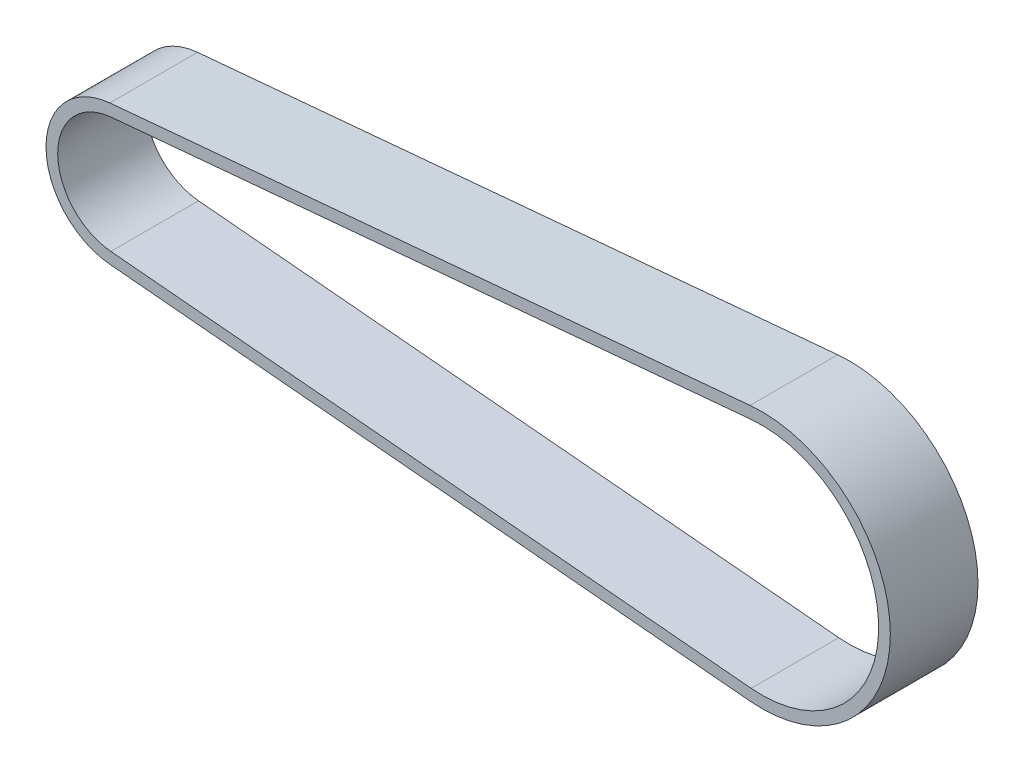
ISO-10303-21;
HEADER;
FILE_DESCRIPTION(('STEP AP214'),'2;1');
FILE_NAME('part.step','',(''),(''),'','','');
FILE_SCHEMA(('AUTOMOTIVE_DESIGN { 1 0 10303 214 1 1 1 1 }'));
ENDSEC;
DATA;
#1=APPLICATION_CONTEXT('core data for automotive mechanical design processes');
#2=APPLICATION_PROTOCOL_DEFINITION('international standard','automotive_design',2000,#1);
#3=PRODUCT_CONTEXT('',#1,'mechanical');
#4=PRODUCT('Part','Part','',(#3));
#5=PRODUCT_RELATED_PRODUCT_CATEGORY('part','',(#4));
#6=PRODUCT_DEFINITION_FORMATION('','',#4);
#7=PRODUCT_DEFINITION_CONTEXT('part definition',#1,'design');
#8=PRODUCT_DEFINITION('design','',#6,#7);
#9=PRODUCT_DEFINITION_SHAPE('','',#8);
#10=(LENGTH_UNIT() NAMED_UNIT(*) SI_UNIT(.MILLI.,.METRE.));
#11=(NAMED_UNIT(*) PLANE_ANGLE_UNIT() SI_UNIT($,.RADIAN.));
#12=(NAMED_UNIT(*) SI_UNIT($,.STERADIAN.) SOLID_ANGLE_UNIT());
#13=UNCERTAINTY_MEASURE_WITH_UNIT(LENGTH_MEASURE(1.E-05),#10,'distance_accuracy_value','');
#14=(GEOMETRIC_REPRESENTATION_CONTEXT(3) GLOBAL_UNCERTAINTY_ASSIGNED_CONTEXT((#13)) GLOBAL_UNIT_ASSIGNED_CONTEXT((#10,
#11,#12)) REPRESENTATION_CONTEXT('',''));
#15=CARTESIAN_POINT('',(0.,0.,0.));
#16=DIRECTION('',(0.,0.,1.));
#17=DIRECTION('',(1.,0.,0.));
#18=AXIS2_PLACEMENT_3D('',#15,#16,#17);
#19=CARTESIAN_POINT('',(110.436855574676,0.,15.));
#20=DIRECTION('',(0.,0.,1.));
#21=DIRECTION('',(1.,0.,0.));
#22=AXIS2_PLACEMENT_3D('',#19,#20,#21);
#23=PLANE('',#22);
#24=CARTESIAN_POINT('',(110.436855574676,0.,15.));
#25=DIRECTION('',(0.,0.,1.));
#26=DIRECTION('',(1.,0.,0.));
#27=AXIS2_PLACEMENT_3D('',#24,#25,#26);
#28=CIRCLE('',#27,22.);
#29=CARTESIAN_POINT('',(108.444766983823,-21.9096230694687,15.));
#30=VERTEX_POINT('',#29);
#31=CARTESIAN_POINT('',(108.444766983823,21.9096230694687,15.));
#32=VERTEX_POINT('',#31);
#33=EDGE_CURVE('E158',#30,#32,#28,.T.);
#34=ORIENTED_EDGE('',*,*,#33,.T.);
#35=DIRECTION('',(-0.995891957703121,-0.0905494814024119,0.));
#36=VECTOR('',#35,1.);
#37=CARTESIAN_POINT('',(-1.08659377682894,11.9507034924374,15.));
#38=LINE('',#37,#36);
#39=CARTESIAN_POINT('',(-1.08659377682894,11.9507034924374,15.));
#40=VERTEX_POINT('',#39);
#41=EDGE_CURVE('E161',#32,#40,#38,.T.);
#42=ORIENTED_EDGE('',*,*,#41,.T.);
#43=CARTESIAN_POINT('',(0.,0.,15.));
#44=DIRECTION('',(0.,0.,1.));
#45=DIRECTION('',(1.,0.,0.));
#46=AXIS2_PLACEMENT_3D('',#43,#44,#45);
#47=CIRCLE('',#46,12.);
#48=CARTESIAN_POINT('',(-1.08659377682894,-11.9507034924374,15.));
#49=VERTEX_POINT('',#48);
#50=EDGE_CURVE('E164',#40,#49,#47,.T.);
#51=ORIENTED_EDGE('',*,*,#50,.T.);
#52=DIRECTION('',(0.995891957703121,-0.0905494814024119,0.));
#53=VECTOR('',#52,1.);
#54=CARTESIAN_POINT('',(-1.08659377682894,-11.9507034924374,15.));
#55=LINE('',#54,#53);
#56=EDGE_CURVE('E166',#49,#30,#55,.T.);
#57=ORIENTED_EDGE('',*,*,#56,.T.);
#58=EDGE_LOOP('',(#34,#42,#51,#57));
#59=FACE_BOUND('',#58,.T.);
#60=DIRECTION('',(-0.995891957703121,-0.0905494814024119,0.));
#61=VECTOR('',#60,1.);
#62=CARTESIAN_POINT('',(-0.905494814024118,9.9589195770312,15.));
#63=LINE('',#62,#61);
#64=CARTESIAN_POINT('',(108.625865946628,19.9178391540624,15.));
#65=VERTEX_POINT('',#64);
#66=CARTESIAN_POINT('',(-0.905494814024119,9.9589195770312,15.));
#67=VERTEX_POINT('',#66);
#68=EDGE_CURVE('E130',#65,#67,#63,.T.);
#69=ORIENTED_EDGE('',*,*,#68,.F.);
#70=CARTESIAN_POINT('',(110.436855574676,0.,15.));
#71=DIRECTION('',(0.,0.,1.));
#72=DIRECTION('',(1.,0.,0.));
#73=AXIS2_PLACEMENT_3D('',#70,#71,#72);
#74=CIRCLE('',#73,20.);
#75=CARTESIAN_POINT('',(108.625865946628,-19.9178391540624,15.));
#76=VERTEX_POINT('',#75);
#77=EDGE_CURVE('E122',#76,#65,#74,.T.);
#78=ORIENTED_EDGE('',*,*,#77,.F.);
#79=DIRECTION('',(0.995891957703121,-0.0905494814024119,0.));
#80=VECTOR('',#79,1.);
#81=CARTESIAN_POINT('',(-0.905494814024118,-9.9589195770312,15.));
#82=LINE('',#81,#80);
#83=CARTESIAN_POINT('',(-0.905494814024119,-9.95891957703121,15.));
#84=VERTEX_POINT('',#83);
#85=EDGE_CURVE('E144',#84,#76,#82,.T.);
#86=ORIENTED_EDGE('',*,*,#85,.F.);
#87=CARTESIAN_POINT('',(0.,0.,15.));
#88=DIRECTION('',(0.,0.,1.));
#89=DIRECTION('',(1.,0.,0.));
#90=AXIS2_PLACEMENT_3D('',#87,#88,#89);
#91=CIRCLE('',#90,10.);
#92=EDGE_CURVE('E142',#67,#84,#91,.T.);
#93=ORIENTED_EDGE('',*,*,#92,.F.);
#94=EDGE_LOOP('',(#69,#78,#86,#93));
#95=FACE_BOUND('',#94,.T.);
#96=ADVANCED_FACE('F57',(#59,#95),#23,.T.);
#97=CARTESIAN_POINT('',(110.436855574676,0.,0.));
#98=DIRECTION('',(0.,0.,1.));
#99=DIRECTION('',(1.,0.,0.));
#100=AXIS2_PLACEMENT_3D('',#97,#98,#99);
#101=PLANE('',#100);
#102=CARTESIAN_POINT('',(110.436855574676,0.,0.));
#103=DIRECTION('',(0.,0.,1.));
#104=DIRECTION('',(1.,0.,0.));
#105=AXIS2_PLACEMENT_3D('',#102,#103,#104);
#106=CIRCLE('',#105,22.);
#107=CARTESIAN_POINT('',(108.444766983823,-21.9096230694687,0.));
#108=VERTEX_POINT('',#107);
#109=CARTESIAN_POINT('',(108.444766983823,21.9096230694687,0.));
#110=VERTEX_POINT('',#109);
#111=EDGE_CURVE('E138',#108,#110,#106,.T.);
#112=ORIENTED_EDGE('',*,*,#111,.F.);
#113=DIRECTION('',(0.995891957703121,-0.0905494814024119,0.));
#114=VECTOR('',#113,1.);
#115=CARTESIAN_POINT('',(-1.08659377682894,-11.9507034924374,0.));
#116=LINE('',#115,#114);
#117=CARTESIAN_POINT('',(-1.08659377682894,-11.9507034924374,0.));
#118=VERTEX_POINT('',#117);
#119=EDGE_CURVE('E162',#118,#108,#116,.T.);
#120=ORIENTED_EDGE('',*,*,#119,.F.);
#121=CARTESIAN_POINT('',(0.,0.,0.));
#122=DIRECTION('',(0.,0.,1.));
#123=DIRECTION('',(1.,0.,0.));
#124=AXIS2_PLACEMENT_3D('',#121,#122,#123);
#125=CIRCLE('',#124,12.);
#126=CARTESIAN_POINT('',(-1.08659377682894,11.9507034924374,0.));
#127=VERTEX_POINT('',#126);
#128=EDGE_CURVE('E173',#127,#118,#125,.T.);
#129=ORIENTED_EDGE('',*,*,#128,.F.);
#130=DIRECTION('',(-0.995891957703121,-0.0905494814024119,0.));
#131=VECTOR('',#130,1.);
#132=CARTESIAN_POINT('',(-1.08659377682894,11.9507034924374,0.));
#133=LINE('',#132,#131);
#134=EDGE_CURVE('E171',#110,#127,#133,.T.);
#135=ORIENTED_EDGE('',*,*,#134,.F.);
#136=EDGE_LOOP('',(#112,#120,#129,#135));
#137=FACE_BOUND('',#136,.T.);
#138=CARTESIAN_POINT('',(110.436855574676,0.,0.));
#139=DIRECTION('',(0.,0.,1.));
#140=DIRECTION('',(1.,0.,0.));
#141=AXIS2_PLACEMENT_3D('',#138,#139,#140);
#142=CIRCLE('',#141,20.);
#143=CARTESIAN_POINT('',(108.625865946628,-19.9178391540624,0.));
#144=VERTEX_POINT('',#143);
#145=CARTESIAN_POINT('',(108.625865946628,19.9178391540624,0.));
#146=VERTEX_POINT('',#145);
#147=EDGE_CURVE('E80',#144,#146,#142,.T.);
#148=ORIENTED_EDGE('',*,*,#147,.T.);
#149=DIRECTION('',(-0.995891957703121,-0.0905494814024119,0.));
#150=VECTOR('',#149,1.);
#151=CARTESIAN_POINT('',(-0.905494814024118,9.9589195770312,0.));
#152=LINE('',#151,#150);
#153=CARTESIAN_POINT('',(-0.905494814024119,9.9589195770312,0.));
#154=VERTEX_POINT('',#153);
#155=EDGE_CURVE('E137',#146,#154,#152,.T.);
#156=ORIENTED_EDGE('',*,*,#155,.T.);
#157=CARTESIAN_POINT('',(0.,0.,0.));
#158=DIRECTION('',(0.,0.,1.));
#159=DIRECTION('',(1.,0.,0.));
#160=AXIS2_PLACEMENT_3D('',#157,#158,#159);
#161=CIRCLE('',#160,10.);
#162=CARTESIAN_POINT('',(-0.905494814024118,-9.9589195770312,0.));
#163=VERTEX_POINT('',#162);
#164=EDGE_CURVE('E150',#154,#163,#161,.T.);
#165=ORIENTED_EDGE('',*,*,#164,.T.);
#166=DIRECTION('',(0.995891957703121,-0.0905494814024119,0.));
#167=VECTOR('',#166,1.);
#168=CARTESIAN_POINT('',(-0.905494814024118,-9.9589195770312,0.));
#169=LINE('',#168,#167);
#170=EDGE_CURVE('E131',#163,#144,#169,.T.);
#171=ORIENTED_EDGE('',*,*,#170,.T.);
#172=EDGE_LOOP('',(#148,#156,#165,#171));
#173=FACE_BOUND('',#172,.T.);
#174=ADVANCED_FACE('F191',(#137,#173),#101,.F.);
#175=CARTESIAN_POINT('',(110.436855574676,0.,15.));
#176=DIRECTION('',(0.,0.,-1.));
#177=DIRECTION('',(-1.,0.,0.));
#178=AXIS2_PLACEMENT_3D('',#175,#176,#177);
#179=CYLINDRICAL_SURFACE('',#178,22.);
#180=ORIENTED_EDGE('',*,*,#111,.T.);
#181=DIRECTION('',(0.,0.,-1.));
#182=VECTOR('',#181,1.);
#183=CARTESIAN_POINT('',(108.444766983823,21.9096230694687,15.));
#184=LINE('',#183,#182);
#185=EDGE_CURVE('E12',#32,#110,#184,.T.);
#186=ORIENTED_EDGE('',*,*,#185,.F.);
#187=ORIENTED_EDGE('',*,*,#33,.F.);
#188=DIRECTION('',(0.,0.,-1.));
#189=VECTOR('',#188,1.);
#190=CARTESIAN_POINT('',(108.444766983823,-21.9096230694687,15.));
#191=LINE('',#190,#189);
#192=EDGE_CURVE('E168',#30,#108,#191,.T.);
#193=ORIENTED_EDGE('',*,*,#192,.T.);
#194=EDGE_LOOP('',(#180,#186,#187,#193));
#195=FACE_BOUND('',#194,.T.);
#196=ADVANCED_FACE('F59',(#195),#179,.T.);
#197=CARTESIAN_POINT('',(-1.08659377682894,11.9507034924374,15.));
#198=DIRECTION('',(0.0905494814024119,-0.995891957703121,0.));
#199=DIRECTION('',(0.995891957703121,0.0905494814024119,0.));
#200=AXIS2_PLACEMENT_3D('',#197,#198,#199);
#201=PLANE('',#200);
#202=ORIENTED_EDGE('',*,*,#134,.T.);
#203=DIRECTION('',(0.,0.,-1.));
#204=VECTOR('',#203,1.);
#205=CARTESIAN_POINT('',(-1.08659377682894,11.9507034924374,15.));
#206=LINE('',#205,#204);
#207=EDGE_CURVE('E65',#40,#127,#206,.T.);
#208=ORIENTED_EDGE('',*,*,#207,.F.);
#209=ORIENTED_EDGE('',*,*,#41,.F.);
#210=ORIENTED_EDGE('',*,*,#185,.T.);
#211=EDGE_LOOP('',(#202,#208,#209,#210));
#212=FACE_BOUND('',#211,.T.);
#213=ADVANCED_FACE('F201',(#212),#201,.F.);
#214=CARTESIAN_POINT('',(0.,0.,15.));
#215=DIRECTION('',(0.,0.,-1.));
#216=DIRECTION('',(-1.,0.,0.));
#217=AXIS2_PLACEMENT_3D('',#214,#215,#216);
#218=CYLINDRICAL_SURFACE('',#217,12.);
#219=ORIENTED_EDGE('',*,*,#128,.T.);
#220=DIRECTION('',(0.,0.,-1.));
#221=VECTOR('',#220,1.);
#222=CARTESIAN_POINT('',(-1.08659377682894,-11.9507034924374,15.));
#223=LINE('',#222,#221);
#224=EDGE_CURVE('E178',#49,#118,#223,.T.);
#225=ORIENTED_EDGE('',*,*,#224,.F.);
#226=ORIENTED_EDGE('',*,*,#50,.F.);
#227=ORIENTED_EDGE('',*,*,#207,.T.);
#228=EDGE_LOOP('',(#219,#225,#226,#227));
#229=FACE_BOUND('',#228,.T.);
#230=ADVANCED_FACE('F185',(#229),#218,.T.);
#231=CARTESIAN_POINT('',(-1.08659377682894,-11.9507034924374,15.));
#232=DIRECTION('',(0.0905494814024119,0.995891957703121,0.));
#233=DIRECTION('',(-0.995891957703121,0.0905494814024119,0.));
#234=AXIS2_PLACEMENT_3D('',#231,#232,#233);
#235=PLANE('',#234);
#236=ORIENTED_EDGE('',*,*,#119,.T.);
#237=ORIENTED_EDGE('',*,*,#192,.F.);
#238=ORIENTED_EDGE('',*,*,#56,.F.);
#239=ORIENTED_EDGE('',*,*,#224,.T.);
#240=EDGE_LOOP('',(#236,#237,#238,#239));
#241=FACE_BOUND('',#240,.T.);
#242=ADVANCED_FACE('F195',(#241),#235,.F.);
#243=CARTESIAN_POINT('',(110.436855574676,0.,15.));
#244=DIRECTION('',(0.,0.,-1.));
#245=DIRECTION('',(-1.,0.,0.));
#246=AXIS2_PLACEMENT_3D('',#243,#244,#245);
#247=CYLINDRICAL_SURFACE('',#246,20.);
#248=ORIENTED_EDGE('',*,*,#147,.F.);
#249=DIRECTION('',(0.,0.,-1.));
#250=VECTOR('',#249,1.);
#251=CARTESIAN_POINT('',(108.625865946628,-19.9178391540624,15.));
#252=LINE('',#251,#250);
#253=EDGE_CURVE('E126',#76,#144,#252,.T.);
#254=ORIENTED_EDGE('',*,*,#253,.F.);
#255=ORIENTED_EDGE('',*,*,#77,.T.);
#256=DIRECTION('',(0.,0.,-1.));
#257=VECTOR('',#256,1.);
#258=CARTESIAN_POINT('',(108.625865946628,19.9178391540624,15.));
#259=LINE('',#258,#257);
#260=EDGE_CURVE('E125',#65,#146,#259,.T.);
#261=ORIENTED_EDGE('',*,*,#260,.T.);
#262=EDGE_LOOP('',(#248,#254,#255,#261));
#263=FACE_BOUND('',#262,.T.);
#264=ADVANCED_FACE('F124',(#263),#247,.F.);
#265=CARTESIAN_POINT('',(-0.905494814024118,9.9589195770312,15.));
#266=DIRECTION('',(0.0905494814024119,-0.995891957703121,0.));
#267=DIRECTION('',(0.995891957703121,0.0905494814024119,0.));
#268=AXIS2_PLACEMENT_3D('',#265,#266,#267);
#269=PLANE('',#268);
#270=ORIENTED_EDGE('',*,*,#155,.F.);
#271=ORIENTED_EDGE('',*,*,#260,.F.);
#272=ORIENTED_EDGE('',*,*,#68,.T.);
#273=DIRECTION('',(0.,0.,-1.));
#274=VECTOR('',#273,1.);
#275=CARTESIAN_POINT('',(-0.905494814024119,9.9589195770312,15.));
#276=LINE('',#275,#274);
#277=EDGE_CURVE('E139',#67,#154,#276,.T.);
#278=ORIENTED_EDGE('',*,*,#277,.T.);
#279=EDGE_LOOP('',(#270,#271,#272,#278));
#280=FACE_BOUND('',#279,.T.);
#281=ADVANCED_FACE('F134',(#280),#269,.T.);
#282=CARTESIAN_POINT('',(0.,0.,15.));
#283=DIRECTION('',(0.,0.,-1.));
#284=DIRECTION('',(-1.,0.,0.));
#285=AXIS2_PLACEMENT_3D('',#282,#283,#284);
#286=CYLINDRICAL_SURFACE('',#285,10.);
#287=ORIENTED_EDGE('',*,*,#164,.F.);
#288=ORIENTED_EDGE('',*,*,#277,.F.);
#289=ORIENTED_EDGE('',*,*,#92,.T.);
#290=DIRECTION('',(0.,0.,-1.));
#291=VECTOR('',#290,1.);
#292=CARTESIAN_POINT('',(-0.905494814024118,-9.9589195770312,15.));
#293=LINE('',#292,#291);
#294=EDGE_CURVE('E72',#84,#163,#293,.T.);
#295=ORIENTED_EDGE('',*,*,#294,.T.);
#296=EDGE_LOOP('',(#287,#288,#289,#295));
#297=FACE_BOUND('',#296,.T.);
#298=ADVANCED_FACE('F224',(#297),#286,.F.);
#299=CARTESIAN_POINT('',(-0.905494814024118,-9.9589195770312,15.));
#300=DIRECTION('',(0.0905494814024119,0.995891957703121,0.));
#301=DIRECTION('',(-0.995891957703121,0.0905494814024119,0.));
#302=AXIS2_PLACEMENT_3D('',#299,#300,#301);
#303=PLANE('',#302);
#304=ORIENTED_EDGE('',*,*,#170,.F.);
#305=ORIENTED_EDGE('',*,*,#294,.F.);
#306=ORIENTED_EDGE('',*,*,#85,.T.);
#307=ORIENTED_EDGE('',*,*,#253,.T.);
#308=EDGE_LOOP('',(#304,#305,#306,#307));
#309=FACE_BOUND('',#308,.T.);
#310=ADVANCED_FACE('F228',(#309),#303,.T.);
#311=CLOSED_SHELL('',(#96,#174,#196,#213,#230,#242,#264,#281,#298,#310));
#312=MANIFOLD_SOLID_BREP('B2',#311);
#313=ADVANCED_BREP_SHAPE_REPRESENTATION('',(#18,#312),#14);
#314=SHAPE_DEFINITION_REPRESENTATION(#9,#313);
ENDSEC;
END-ISO-10303-21;
